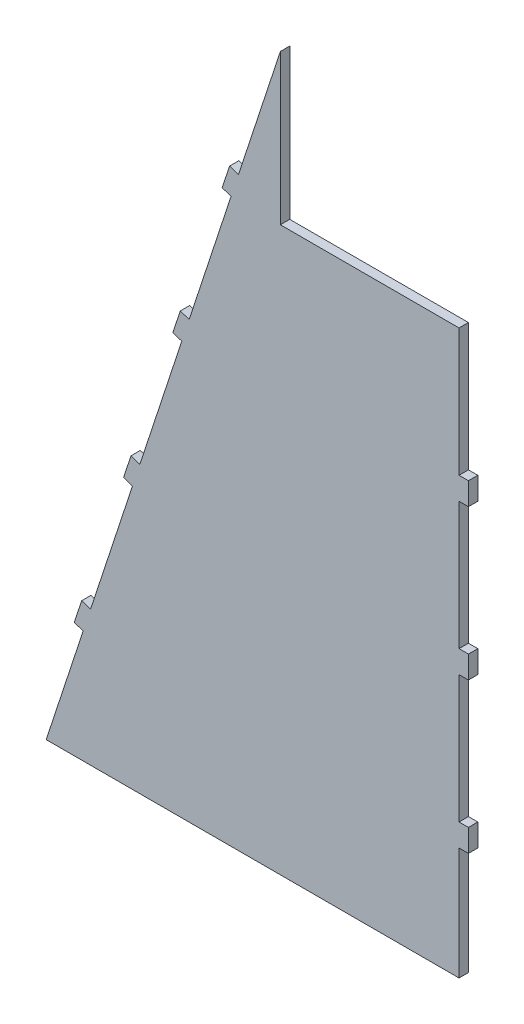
from build123d import *

# Parameters (mm, degrees)
EXTRUDE_1_DEPTH = 2.5


with BuildPart() as part:
    # Sketch 1 → Extrude 1 (new body)
    with BuildSketch(Plane.XY):
        Polygon((34.318995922, 24.090242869), (36.818995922, 24.090242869), (36.818995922, 18.090242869), (34.318995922, 18.090242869), (34.318995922, -15.909757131), (36.818995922, -15.909757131), (36.818995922, -21.909757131), (34.318995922, -21.909757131), (34.318995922, -51.909757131), (-75.681004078, -51.909757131), (-65.829075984, -21.909757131), (-68.204277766, -21.129746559), (-66.233892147, -15.129746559), (-63.858690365, -15.909757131), (-52.693171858, 18.090242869), (-55.06837364, 18.870253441), (-53.097988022, 24.870253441), (-50.722786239, 24.090242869), (-39.557267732, 58.090242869), (-41.932469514, 58.870253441), (-39.962083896, 64.870253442), (-37.586882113, 64.090242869), (-26.421889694, 98.088640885), (-28.797091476, 98.868651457), (-26.826705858, 104.868651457), (-24.451504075, 104.088640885), (-13.28545948, 138.090242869), (-13.28545948, 98.090242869), (34.318995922, 98.090242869), (34.318995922, 64.090242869), (36.818995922, 64.090242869), (36.818995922, 58.090242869), (34.318995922, 58.090242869), align=None)
    extrude(amount=EXTRUDE_1_DEPTH)


solid = part.part
